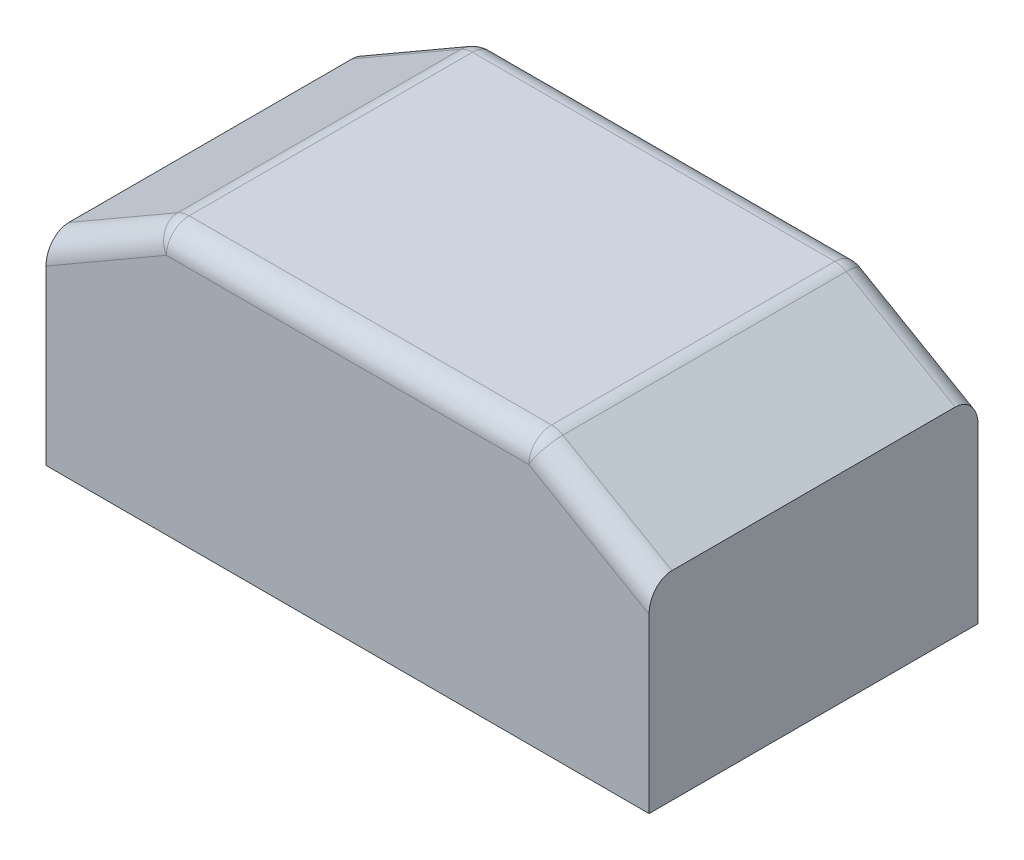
from build123d import *

# Parameters (mm, degrees)
CROQUIS1_W              = 132
CROQUIS1_H              = 72
SALIENTE_EXTRUIR1_DEPTH = 58
CHAFL_N1_SIZE           = 25
CHAFL_N1_SIZE2          = 14.43375673
REDONDEO1_R             = 5


with BuildPart() as part:
    # Croquis1 → Saliente-Extruir1 (new body)
    with BuildSketch(Plane(origin=(0, 0, 0), x_dir=(1, 0, 0), z_dir=(0, 1, 0))):
        with Locations((66, 36)):
            Rectangle(CROQUIS1_W, CROQUIS1_H)
    extrude(amount=SALIENTE_EXTRUIR1_DEPTH)

    # Chafl_n1
    chafl_n1_edges = [part.edges().sort_by_distance(p)[0] for p in [
        (132, 58, -36),
        (0, 58, -36),
    ]]
    chafl_n1_side = [part.faces().sort_by_distance(p)[0] for p in [
        (66, 58, -36),
    ]]
    chamfer(chafl_n1_edges, length=CHAFL_N1_SIZE, length2=CHAFL_N1_SIZE2, reference=chafl_n1_side[0])

    # Redondeo1
    redondeo1_edges = [part.edges().sort_by_distance(p)[0] for p in [
        (66, 58, 0),
        (66, 58, -72),
        (107, 58, -36),
        (25, 58, -36),
        (119.5, 50.783121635, 0),
        (12.5, 50.783121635, 0),
        (119.5, 50.783121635, -72),
        (12.5, 50.783121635, -72),
    ]]
    fillet(redondeo1_edges, radius=REDONDEO1_R)


solid = part.part
